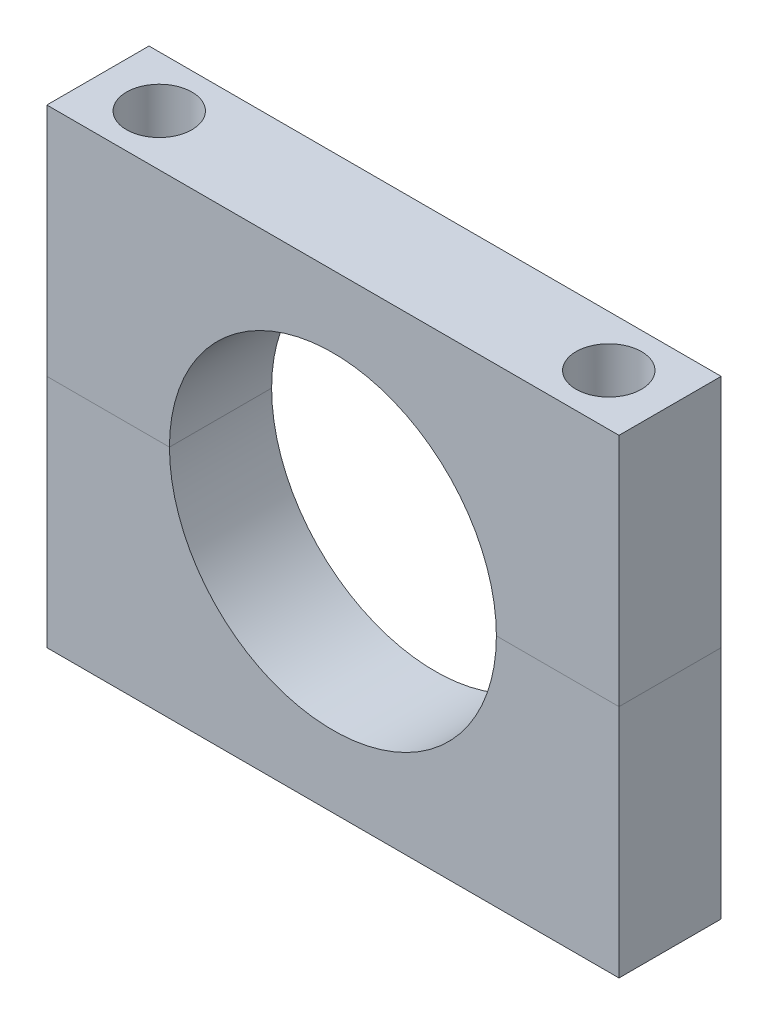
ISO-10303-21;
HEADER;
FILE_DESCRIPTION(('STEP AP214'),'2;1');
FILE_NAME('part.step','',(''),(''),'','','');
FILE_SCHEMA(('AUTOMOTIVE_DESIGN { 1 0 10303 214 1 1 1 1 }'));
ENDSEC;
DATA;
#1=APPLICATION_CONTEXT('core data for automotive mechanical design processes');
#2=APPLICATION_PROTOCOL_DEFINITION('international standard','automotive_design',2000,#1);
#3=PRODUCT_CONTEXT('',#1,'mechanical');
#4=PRODUCT('Part','Part','',(#3));
#5=PRODUCT_RELATED_PRODUCT_CATEGORY('part','',(#4));
#6=PRODUCT_DEFINITION_FORMATION('','',#4);
#7=PRODUCT_DEFINITION_CONTEXT('part definition',#1,'design');
#8=PRODUCT_DEFINITION('design','',#6,#7);
#9=PRODUCT_DEFINITION_SHAPE('','',#8);
#10=(LENGTH_UNIT() NAMED_UNIT(*) SI_UNIT(.MILLI.,.METRE.));
#11=(NAMED_UNIT(*) PLANE_ANGLE_UNIT() SI_UNIT($,.RADIAN.));
#12=(NAMED_UNIT(*) SI_UNIT($,.STERADIAN.) SOLID_ANGLE_UNIT());
#13=UNCERTAINTY_MEASURE_WITH_UNIT(LENGTH_MEASURE(1.E-05),#10,'distance_accuracy_value','');
#14=(GEOMETRIC_REPRESENTATION_CONTEXT(3) GLOBAL_UNCERTAINTY_ASSIGNED_CONTEXT((#13)) GLOBAL_UNIT_ASSIGNED_CONTEXT((#10,
#11,#12)) REPRESENTATION_CONTEXT('',''));
#15=CARTESIAN_POINT('',(0.,0.,0.));
#16=DIRECTION('',(0.,0.,1.));
#17=DIRECTION('',(1.,0.,0.));
#18=AXIS2_PLACEMENT_3D('',#15,#16,#17);
#19=CARTESIAN_POINT('',(0.,0.,0.));
#20=DIRECTION('',(0.,1.,0.));
#21=DIRECTION('',(0.,0.,1.));
#22=AXIS2_PLACEMENT_3D('',#19,#20,#21);
#23=PLANE('',#22);
#24=DIRECTION('',(1.,0.,0.));
#25=VECTOR('',#24,1.);
#26=CARTESIAN_POINT('',(0.,0.,5.));
#27=LINE('',#26,#25);
#28=CARTESIAN_POINT('',(7.99999999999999,0.,5.));
#29=VERTEX_POINT('',#28);
#30=CARTESIAN_POINT('',(14.,0.,5.));
#31=VERTEX_POINT('',#30);
#32=EDGE_CURVE('E151',#29,#31,#27,.T.);
#33=ORIENTED_EDGE('',*,*,#32,.T.);
#34=DIRECTION('',(0.,0.,-1.));
#35=VECTOR('',#34,1.);
#36=CARTESIAN_POINT('',(14.,0.,5.));
#37=LINE('',#36,#35);
#38=CARTESIAN_POINT('',(14.,0.,0.));
#39=VERTEX_POINT('',#38);
#40=EDGE_CURVE('E145',#31,#39,#37,.T.);
#41=ORIENTED_EDGE('',*,*,#40,.T.);
#42=DIRECTION('',(1.,0.,0.));
#43=VECTOR('',#42,1.);
#44=CARTESIAN_POINT('',(0.,0.,0.));
#45=LINE('',#44,#43);
#46=CARTESIAN_POINT('',(7.99999999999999,0.,0.));
#47=VERTEX_POINT('',#46);
#48=EDGE_CURVE('E138',#47,#39,#45,.T.);
#49=ORIENTED_EDGE('',*,*,#48,.F.);
#50=DIRECTION('',(0.,0.,-1.));
#51=VECTOR('',#50,1.);
#52=CARTESIAN_POINT('',(7.99999999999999,0.,5.));
#53=LINE('',#52,#51);
#54=EDGE_CURVE('E98',#29,#47,#53,.T.);
#55=ORIENTED_EDGE('',*,*,#54,.F.);
#56=EDGE_LOOP('',(#33,#41,#49,#55));
#57=FACE_BOUND('',#56,.T.);
#58=CARTESIAN_POINT('',(11.,0.,2.5));
#59=DIRECTION('',(0.,1.,0.));
#60=DIRECTION('',(0.,0.,1.));
#61=AXIS2_PLACEMENT_3D('',#58,#59,#60);
#62=CIRCLE('',#61,1.6);
#63=CARTESIAN_POINT('',(11.,0.,4.1));
#64=VERTEX_POINT('',#63);
#65=EDGE_CURVE('E146',#64,#64,#62,.F.);
#66=ORIENTED_EDGE('',*,*,#65,.T.);
#67=EDGE_LOOP('',(#66));
#68=FACE_BOUND('',#67,.T.);
#69=ADVANCED_FACE('F58',(#57,#68),#23,.T.);
#70=CARTESIAN_POINT('',(-14.,0.,0.));
#71=VERTEX_POINT('',#70);
#72=CARTESIAN_POINT('',(-8.00000000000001,0.,0.));
#73=VERTEX_POINT('',#72);
#74=EDGE_CURVE('E123',#71,#73,#45,.T.);
#75=ORIENTED_EDGE('',*,*,#74,.F.);
#76=DIRECTION('',(0.,0.,1.));
#77=VECTOR('',#76,1.);
#78=CARTESIAN_POINT('',(-14.,0.,5.));
#79=LINE('',#78,#77);
#80=CARTESIAN_POINT('',(-14.,0.,5.));
#81=VERTEX_POINT('',#80);
#82=EDGE_CURVE('E135',#71,#81,#79,.T.);
#83=ORIENTED_EDGE('',*,*,#82,.T.);
#84=CARTESIAN_POINT('',(-8.00000000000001,0.,5.));
#85=VERTEX_POINT('',#84);
#86=EDGE_CURVE('E139',#81,#85,#27,.T.);
#87=ORIENTED_EDGE('',*,*,#86,.T.);
#88=DIRECTION('',(0.,0.,-1.));
#89=VECTOR('',#88,1.);
#90=CARTESIAN_POINT('',(-8.00000000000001,0.,5.));
#91=LINE('',#90,#89);
#92=EDGE_CURVE('E136',#73,#85,#91,.F.);
#93=ORIENTED_EDGE('',*,*,#92,.F.);
#94=EDGE_LOOP('',(#75,#83,#87,#93));
#95=FACE_BOUND('',#94,.T.);
#96=CARTESIAN_POINT('',(-11.,0.,2.5));
#97=DIRECTION('',(0.,1.,0.));
#98=DIRECTION('',(0.,0.,1.));
#99=AXIS2_PLACEMENT_3D('',#96,#97,#98);
#100=CIRCLE('',#99,1.6);
#101=CARTESIAN_POINT('',(-11.,0.,4.1));
#102=VERTEX_POINT('',#101);
#103=EDGE_CURVE('E154',#102,#102,#100,.F.);
#104=ORIENTED_EDGE('',*,*,#103,.T.);
#105=EDGE_LOOP('',(#104));
#106=FACE_BOUND('',#105,.T.);
#107=ADVANCED_FACE('F132',(#95,#106),#23,.T.);
#108=CARTESIAN_POINT('',(0.,0.,5.));
#109=DIRECTION('',(0.,0.,-1.));
#110=DIRECTION('',(-1.,0.,0.));
#111=AXIS2_PLACEMENT_3D('',#108,#109,#110);
#112=PLANE('',#111);
#113=ORIENTED_EDGE('',*,*,#86,.F.);
#114=DIRECTION('',(0.,-1.,0.));
#115=VECTOR('',#114,1.);
#116=CARTESIAN_POINT('',(-14.,-11.5,5.));
#117=LINE('',#116,#115);
#118=CARTESIAN_POINT('',(-14.,-11.5,5.));
#119=VERTEX_POINT('',#118);
#120=EDGE_CURVE('E142',#81,#119,#117,.T.);
#121=ORIENTED_EDGE('',*,*,#120,.T.);
#122=DIRECTION('',(1.,0.,0.));
#123=VECTOR('',#122,1.);
#124=CARTESIAN_POINT('',(-14.,-11.5,5.));
#125=LINE('',#124,#123);
#126=CARTESIAN_POINT('',(14.,-11.5,5.));
#127=VERTEX_POINT('',#126);
#128=EDGE_CURVE('E90',#119,#127,#125,.T.);
#129=ORIENTED_EDGE('',*,*,#128,.T.);
#130=DIRECTION('',(0.,1.,0.));
#131=VECTOR('',#130,1.);
#132=CARTESIAN_POINT('',(14.,-11.5,5.));
#133=LINE('',#132,#131);
#134=EDGE_CURVE('E163',#127,#31,#133,.T.);
#135=ORIENTED_EDGE('',*,*,#134,.T.);
#136=ORIENTED_EDGE('',*,*,#32,.F.);
#137=CARTESIAN_POINT('',(0.,0.,5.));
#138=DIRECTION('',(0.,0.,1.));
#139=DIRECTION('',(1.,0.,0.));
#140=AXIS2_PLACEMENT_3D('',#137,#138,#139);
#141=CIRCLE('',#140,8.);
#142=EDGE_CURVE('E167',#85,#29,#141,.T.);
#143=ORIENTED_EDGE('',*,*,#142,.F.);
#144=EDGE_LOOP('',(#113,#121,#129,#135,#136,#143));
#145=FACE_BOUND('',#144,.T.);
#146=ADVANCED_FACE('F188',(#145),#112,.F.);
#147=CARTESIAN_POINT('',(0.,0.,0.));
#148=DIRECTION('',(0.,0.,-1.));
#149=DIRECTION('',(-1.,0.,0.));
#150=AXIS2_PLACEMENT_3D('',#147,#148,#149);
#151=PLANE('',#150);
#152=DIRECTION('',(0.,-1.,0.));
#153=VECTOR('',#152,1.);
#154=CARTESIAN_POINT('',(-14.,-11.5,0.));
#155=LINE('',#154,#153);
#156=CARTESIAN_POINT('',(-14.,-11.5,0.));
#157=VERTEX_POINT('',#156);
#158=EDGE_CURVE('E78',#71,#157,#155,.T.);
#159=ORIENTED_EDGE('',*,*,#158,.F.);
#160=ORIENTED_EDGE('',*,*,#74,.T.);
#161=CARTESIAN_POINT('',(0.,0.,0.));
#162=DIRECTION('',(0.,0.,1.));
#163=DIRECTION('',(1.,0.,0.));
#164=AXIS2_PLACEMENT_3D('',#161,#162,#163);
#165=CIRCLE('',#164,8.);
#166=EDGE_CURVE('E62',#73,#47,#165,.T.);
#167=ORIENTED_EDGE('',*,*,#166,.T.);
#168=ORIENTED_EDGE('',*,*,#48,.T.);
#169=DIRECTION('',(0.,1.,0.));
#170=VECTOR('',#169,1.);
#171=CARTESIAN_POINT('',(14.,-11.5,0.));
#172=LINE('',#171,#170);
#173=CARTESIAN_POINT('',(14.,-11.5,0.));
#174=VERTEX_POINT('',#173);
#175=EDGE_CURVE('E128',#174,#39,#172,.T.);
#176=ORIENTED_EDGE('',*,*,#175,.F.);
#177=DIRECTION('',(1.,0.,0.));
#178=VECTOR('',#177,1.);
#179=CARTESIAN_POINT('',(-14.,-11.5,0.));
#180=LINE('',#179,#178);
#181=EDGE_CURVE('E126',#157,#174,#180,.T.);
#182=ORIENTED_EDGE('',*,*,#181,.F.);
#183=EDGE_LOOP('',(#159,#160,#167,#168,#176,#182));
#184=FACE_BOUND('',#183,.T.);
#185=ADVANCED_FACE('F121',(#184),#151,.T.);
#186=CARTESIAN_POINT('',(14.,-11.5,5.));
#187=DIRECTION('',(-1.,0.,0.));
#188=DIRECTION('',(0.,0.,1.));
#189=AXIS2_PLACEMENT_3D('',#186,#187,#188);
#190=PLANE('',#189);
#191=ORIENTED_EDGE('',*,*,#40,.F.);
#192=ORIENTED_EDGE('',*,*,#134,.F.);
#193=DIRECTION('',(0.,0.,-1.));
#194=VECTOR('',#193,1.);
#195=CARTESIAN_POINT('',(14.,-11.5,5.));
#196=LINE('',#195,#194);
#197=EDGE_CURVE('E192',#127,#174,#196,.T.);
#198=ORIENTED_EDGE('',*,*,#197,.T.);
#199=ORIENTED_EDGE('',*,*,#175,.T.);
#200=EDGE_LOOP('',(#191,#192,#198,#199));
#201=FACE_BOUND('',#200,.T.);
#202=ADVANCED_FACE('F60',(#201),#190,.F.);
#203=CARTESIAN_POINT('',(-14.,-11.5,5.));
#204=DIRECTION('',(1.,0.,0.));
#205=DIRECTION('',(0.,0.,-1.));
#206=AXIS2_PLACEMENT_3D('',#203,#204,#205);
#207=PLANE('',#206);
#208=ORIENTED_EDGE('',*,*,#82,.F.);
#209=ORIENTED_EDGE('',*,*,#158,.T.);
#210=DIRECTION('',(0.,0.,-1.));
#211=VECTOR('',#210,1.);
#212=CARTESIAN_POINT('',(-14.,-11.5,5.));
#213=LINE('',#212,#211);
#214=EDGE_CURVE('E183',#119,#157,#213,.T.);
#215=ORIENTED_EDGE('',*,*,#214,.F.);
#216=ORIENTED_EDGE('',*,*,#120,.F.);
#217=EDGE_LOOP('',(#208,#209,#215,#216));
#218=FACE_BOUND('',#217,.T.);
#219=ADVANCED_FACE('F141',(#218),#207,.F.);
#220=CARTESIAN_POINT('',(0.,0.,5.));
#221=DIRECTION('',(0.,0.,-1.));
#222=DIRECTION('',(-1.,0.,0.));
#223=AXIS2_PLACEMENT_3D('',#220,#221,#222);
#224=CYLINDRICAL_SURFACE('',#223,8.);
#225=ORIENTED_EDGE('',*,*,#142,.T.);
#226=ORIENTED_EDGE('',*,*,#54,.T.);
#227=ORIENTED_EDGE('',*,*,#166,.F.);
#228=ORIENTED_EDGE('',*,*,#92,.T.);
#229=EDGE_LOOP('',(#225,#226,#227,#228));
#230=FACE_BOUND('',#229,.T.);
#231=ADVANCED_FACE('F224',(#230),#224,.F.);
#232=CARTESIAN_POINT('',(11.,-11.5,2.5));
#233=DIRECTION('',(0.,1.,0.));
#234=DIRECTION('',(0.,0.,1.));
#235=AXIS2_PLACEMENT_3D('',#232,#233,#234);
#236=CYLINDRICAL_SURFACE('',#235,1.6);
#237=CARTESIAN_POINT('',(11.,-11.5,2.5));
#238=DIRECTION('',(0.,1.,0.));
#239=DIRECTION('',(0.,0.,-1.));
#240=AXIS2_PLACEMENT_3D('',#237,#238,#239);
#241=CIRCLE('',#240,1.6);
#242=CARTESIAN_POINT('',(11.,-11.5,0.899999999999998));
#243=VERTEX_POINT('',#242);
#244=EDGE_CURVE('E12',#243,#243,#241,.T.);
#245=ORIENTED_EDGE('',*,*,#244,.F.);
#246=EDGE_LOOP('',(#245));
#247=FACE_BOUND('',#246,.T.);
#248=ORIENTED_EDGE('',*,*,#65,.F.);
#249=EDGE_LOOP('',(#248));
#250=FACE_BOUND('',#249,.T.);
#251=ADVANCED_FACE('F210',(#247,#250),#236,.F.);
#252=CARTESIAN_POINT('',(-11.,-11.5,2.5));
#253=DIRECTION('',(0.,1.,0.));
#254=DIRECTION('',(0.,0.,1.));
#255=AXIS2_PLACEMENT_3D('',#252,#253,#254);
#256=CYLINDRICAL_SURFACE('',#255,1.6);
#257=CARTESIAN_POINT('',(-11.,-11.5,2.5));
#258=DIRECTION('',(0.,1.,0.));
#259=DIRECTION('',(0.,0.,1.));
#260=AXIS2_PLACEMENT_3D('',#257,#258,#259);
#261=CIRCLE('',#260,1.6);
#262=CARTESIAN_POINT('',(-11.,-11.5,4.1));
#263=VERTEX_POINT('',#262);
#264=EDGE_CURVE('E69',#263,#263,#261,.T.);
#265=ORIENTED_EDGE('',*,*,#264,.F.);
#266=EDGE_LOOP('',(#265));
#267=FACE_BOUND('',#266,.T.);
#268=ORIENTED_EDGE('',*,*,#103,.F.);
#269=EDGE_LOOP('',(#268));
#270=FACE_BOUND('',#269,.T.);
#271=ADVANCED_FACE('F205',(#267,#270),#256,.F.);
#272=CARTESIAN_POINT('',(-14.,-11.5,5.));
#273=DIRECTION('',(0.,1.,0.));
#274=DIRECTION('',(0.,0.,1.));
#275=AXIS2_PLACEMENT_3D('',#272,#273,#274);
#276=PLANE('',#275);
#277=ORIENTED_EDGE('',*,*,#264,.T.);
#278=EDGE_LOOP('',(#277));
#279=FACE_BOUND('',#278,.T.);
#280=ORIENTED_EDGE('',*,*,#244,.T.);
#281=EDGE_LOOP('',(#280));
#282=FACE_BOUND('',#281,.T.);
#283=ORIENTED_EDGE('',*,*,#181,.T.);
#284=ORIENTED_EDGE('',*,*,#197,.F.);
#285=ORIENTED_EDGE('',*,*,#128,.F.);
#286=ORIENTED_EDGE('',*,*,#214,.T.);
#287=EDGE_LOOP('',(#283,#284,#285,#286));
#288=FACE_BOUND('',#287,.T.);
#289=ADVANCED_FACE('F203',(#279,#282,#288),#276,.F.);
#290=CLOSED_SHELL('',(#69,#107,#146,#185,#202,#219,#231,#251,#271,#289));
#291=MANIFOLD_SOLID_BREP('B2',#290);
#292=CARTESIAN_POINT('',(0.,0.,0.));
#293=DIRECTION('',(0.,1.,0.));
#294=DIRECTION('',(0.,0.,1.));
#295=AXIS2_PLACEMENT_3D('',#292,#293,#294);
#296=PLANE('',#295);
#297=CARTESIAN_POINT('',(11.,0.,2.5));
#298=DIRECTION('',(0.,1.,0.));
#299=DIRECTION('',(0.,0.,1.));
#300=AXIS2_PLACEMENT_3D('',#297,#298,#299);
#301=CIRCLE('',#300,1.6);
#302=CARTESIAN_POINT('',(11.,0.,4.1));
#303=VERTEX_POINT('',#302);
#304=EDGE_CURVE('E391',#303,#303,#301,.F.);
#305=ORIENTED_EDGE('',*,*,#304,.F.);
#306=EDGE_LOOP('',(#305));
#307=FACE_BOUND('',#306,.T.);
#308=DIRECTION('',(1.,0.,0.));
#309=VECTOR('',#308,1.);
#310=CARTESIAN_POINT('',(0.,0.,5.));
#311=LINE('',#310,#309);
#312=CARTESIAN_POINT('',(7.99999999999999,0.,5.));
#313=VERTEX_POINT('',#312);
#314=CARTESIAN_POINT('',(14.,0.,5.));
#315=VERTEX_POINT('',#314);
#316=EDGE_CURVE('E370',#313,#315,#311,.T.);
#317=ORIENTED_EDGE('',*,*,#316,.F.);
#318=DIRECTION('',(0.,0.,-1.));
#319=VECTOR('',#318,1.);
#320=CARTESIAN_POINT('',(7.99999999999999,0.,5.));
#321=LINE('',#320,#319);
#322=CARTESIAN_POINT('',(7.99999999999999,0.,0.));
#323=VERTEX_POINT('',#322);
#324=EDGE_CURVE('E318',#313,#323,#321,.T.);
#325=ORIENTED_EDGE('',*,*,#324,.T.);
#326=DIRECTION('',(1.,0.,0.));
#327=VECTOR('',#326,1.);
#328=CARTESIAN_POINT('',(0.,0.,0.));
#329=LINE('',#328,#327);
#330=CARTESIAN_POINT('',(14.,0.,0.));
#331=VERTEX_POINT('',#330);
#332=EDGE_CURVE('E399',#323,#331,#329,.T.);
#333=ORIENTED_EDGE('',*,*,#332,.T.);
#334=DIRECTION('',(0.,0.,-1.));
#335=VECTOR('',#334,1.);
#336=CARTESIAN_POINT('',(14.,0.,5.));
#337=LINE('',#336,#335);
#338=EDGE_CURVE('E313',#315,#331,#337,.T.);
#339=ORIENTED_EDGE('',*,*,#338,.F.);
#340=EDGE_LOOP('',(#317,#325,#333,#339));
#341=FACE_BOUND('',#340,.T.);
#342=ADVANCED_FACE('F310',(#307,#341),#296,.F.);
#343=CARTESIAN_POINT('',(-11.,0.,2.5));
#344=DIRECTION('',(0.,1.,0.));
#345=DIRECTION('',(0.,0.,1.));
#346=AXIS2_PLACEMENT_3D('',#343,#344,#345);
#347=CIRCLE('',#346,1.6);
#348=CARTESIAN_POINT('',(-11.,0.,4.1));
#349=VERTEX_POINT('',#348);
#350=EDGE_CURVE('E388',#349,#349,#347,.F.);
#351=ORIENTED_EDGE('',*,*,#350,.F.);
#352=EDGE_LOOP('',(#351));
#353=FACE_BOUND('',#352,.T.);
#354=CARTESIAN_POINT('',(-14.,0.,0.));
#355=VERTEX_POINT('',#354);
#356=CARTESIAN_POINT('',(-8.00000000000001,0.,0.));
#357=VERTEX_POINT('',#356);
#358=EDGE_CURVE('E402',#355,#357,#329,.T.);
#359=ORIENTED_EDGE('',*,*,#358,.T.);
#360=DIRECTION('',(0.,0.,-1.));
#361=VECTOR('',#360,1.);
#362=CARTESIAN_POINT('',(-8.00000000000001,0.,5.));
#363=LINE('',#362,#361);
#364=CARTESIAN_POINT('',(-8.00000000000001,0.,5.));
#365=VERTEX_POINT('',#364);
#366=EDGE_CURVE('E56',#357,#365,#363,.F.);
#367=ORIENTED_EDGE('',*,*,#366,.T.);
#368=CARTESIAN_POINT('',(-14.,0.,5.));
#369=VERTEX_POINT('',#368);
#370=EDGE_CURVE('E333',#369,#365,#311,.T.);
#371=ORIENTED_EDGE('',*,*,#370,.F.);
#372=DIRECTION('',(0.,0.,1.));
#373=VECTOR('',#372,1.);
#374=CARTESIAN_POINT('',(-14.,0.,5.));
#375=LINE('',#374,#373);
#376=EDGE_CURVE('E397',#355,#369,#375,.T.);
#377=ORIENTED_EDGE('',*,*,#376,.F.);
#378=EDGE_LOOP('',(#359,#367,#371,#377));
#379=FACE_BOUND('',#378,.T.);
#380=ADVANCED_FACE('F429',(#353,#379),#296,.F.);
#381=CARTESIAN_POINT('',(-14.,11.5,5.));
#382=DIRECTION('',(0.,-1.,0.));
#383=DIRECTION('',(0.,0.,-1.));
#384=AXIS2_PLACEMENT_3D('',#381,#382,#383);
#385=PLANE('',#384);
#386=CARTESIAN_POINT('',(-11.,11.5,2.5));
#387=DIRECTION('',(0.,1.,0.));
#388=DIRECTION('',(0.,0.,1.));
#389=AXIS2_PLACEMENT_3D('',#386,#387,#388);
#390=CIRCLE('',#389,1.6);
#391=CARTESIAN_POINT('',(-11.,11.5,4.1));
#392=VERTEX_POINT('',#391);
#393=EDGE_CURVE('E412',#392,#392,#390,.T.);
#394=ORIENTED_EDGE('',*,*,#393,.F.);
#395=EDGE_LOOP('',(#394));
#396=FACE_BOUND('',#395,.T.);
#397=CARTESIAN_POINT('',(11.,11.5,2.5));
#398=DIRECTION('',(0.,1.,0.));
#399=DIRECTION('',(0.,0.,-1.));
#400=AXIS2_PLACEMENT_3D('',#397,#398,#399);
#401=CIRCLE('',#400,1.6);
#402=CARTESIAN_POINT('',(11.,11.5,0.899999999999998));
#403=VERTEX_POINT('',#402);
#404=EDGE_CURVE('E416',#403,#403,#401,.T.);
#405=ORIENTED_EDGE('',*,*,#404,.F.);
#406=EDGE_LOOP('',(#405));
#407=FACE_BOUND('',#406,.T.);
#408=DIRECTION('',(-1.,0.,0.));
#409=VECTOR('',#408,1.);
#410=CARTESIAN_POINT('',(-14.,11.5,0.));
#411=LINE('',#410,#409);
#412=CARTESIAN_POINT('',(14.,11.5,0.));
#413=VERTEX_POINT('',#412);
#414=CARTESIAN_POINT('',(-14.,11.5,0.));
#415=VERTEX_POINT('',#414);
#416=EDGE_CURVE('E422',#413,#415,#411,.T.);
#417=ORIENTED_EDGE('',*,*,#416,.T.);
#418=DIRECTION('',(0.,0.,-1.));
#419=VECTOR('',#418,1.);
#420=CARTESIAN_POINT('',(-14.,11.5,5.));
#421=LINE('',#420,#419);
#422=CARTESIAN_POINT('',(-14.,11.5,5.));
#423=VERTEX_POINT('',#422);
#424=EDGE_CURVE('E380',#423,#415,#421,.T.);
#425=ORIENTED_EDGE('',*,*,#424,.F.);
#426=DIRECTION('',(-1.,0.,0.));
#427=VECTOR('',#426,1.);
#428=CARTESIAN_POINT('',(-14.,11.5,5.));
#429=LINE('',#428,#427);
#430=CARTESIAN_POINT('',(14.,11.5,5.));
#431=VERTEX_POINT('',#430);
#432=EDGE_CURVE('E368',#431,#423,#429,.T.);
#433=ORIENTED_EDGE('',*,*,#432,.F.);
#434=DIRECTION('',(0.,0.,-1.));
#435=VECTOR('',#434,1.);
#436=CARTESIAN_POINT('',(14.,11.5,5.));
#437=LINE('',#436,#435);
#438=EDGE_CURVE('E378',#431,#413,#437,.T.);
#439=ORIENTED_EDGE('',*,*,#438,.T.);
#440=EDGE_LOOP('',(#417,#425,#433,#439));
#441=FACE_BOUND('',#440,.T.);
#442=ADVANCED_FACE('F377',(#396,#407,#441),#385,.F.);
#443=CARTESIAN_POINT('',(-11.,-11.5,2.5));
#444=DIRECTION('',(0.,1.,0.));
#445=DIRECTION('',(0.,0.,1.));
#446=AXIS2_PLACEMENT_3D('',#443,#444,#445);
#447=CYLINDRICAL_SURFACE('',#446,1.6);
#448=ORIENTED_EDGE('',*,*,#350,.T.);
#449=EDGE_LOOP('',(#448));
#450=FACE_BOUND('',#449,.T.);
#451=ORIENTED_EDGE('',*,*,#393,.T.);
#452=EDGE_LOOP('',(#451));
#453=FACE_BOUND('',#452,.T.);
#454=ADVANCED_FACE('F436',(#450,#453),#447,.F.);
#455=CARTESIAN_POINT('',(11.,-11.5,2.5));
#456=DIRECTION('',(0.,1.,0.));
#457=DIRECTION('',(0.,0.,1.));
#458=AXIS2_PLACEMENT_3D('',#455,#456,#457);
#459=CYLINDRICAL_SURFACE('',#458,1.6);
#460=ORIENTED_EDGE('',*,*,#304,.T.);
#461=EDGE_LOOP('',(#460));
#462=FACE_BOUND('',#461,.T.);
#463=ORIENTED_EDGE('',*,*,#404,.T.);
#464=EDGE_LOOP('',(#463));
#465=FACE_BOUND('',#464,.T.);
#466=ADVANCED_FACE('F449',(#462,#465),#459,.F.);
#467=CARTESIAN_POINT('',(0.,0.,0.));
#468=DIRECTION('',(0.,0.,-1.));
#469=DIRECTION('',(-1.,0.,0.));
#470=AXIS2_PLACEMENT_3D('',#467,#468,#469);
#471=PLANE('',#470);
#472=ORIENTED_EDGE('',*,*,#358,.F.);
#473=DIRECTION('',(0.,-1.,0.));
#474=VECTOR('',#473,1.);
#475=CARTESIAN_POINT('',(-14.,-11.5,0.));
#476=LINE('',#475,#474);
#477=EDGE_CURVE('E373',#415,#355,#476,.T.);
#478=ORIENTED_EDGE('',*,*,#477,.F.);
#479=ORIENTED_EDGE('',*,*,#416,.F.);
#480=DIRECTION('',(0.,1.,0.));
#481=VECTOR('',#480,1.);
#482=CARTESIAN_POINT('',(14.,-11.5,0.));
#483=LINE('',#482,#481);
#484=EDGE_CURVE('E386',#331,#413,#483,.T.);
#485=ORIENTED_EDGE('',*,*,#484,.F.);
#486=ORIENTED_EDGE('',*,*,#332,.F.);
#487=CARTESIAN_POINT('',(0.,0.,0.));
#488=DIRECTION('',(0.,0.,1.));
#489=DIRECTION('',(1.,0.,0.));
#490=AXIS2_PLACEMENT_3D('',#487,#488,#489);
#491=CIRCLE('',#490,8.);
#492=EDGE_CURVE('E406',#323,#357,#491,.T.);
#493=ORIENTED_EDGE('',*,*,#492,.T.);
#494=EDGE_LOOP('',(#472,#478,#479,#485,#486,#493));
#495=FACE_BOUND('',#494,.T.);
#496=ADVANCED_FACE('F427',(#495),#471,.T.);
#497=CARTESIAN_POINT('',(0.,0.,5.));
#498=DIRECTION('',(0.,0.,-1.));
#499=DIRECTION('',(-1.,0.,0.));
#500=AXIS2_PLACEMENT_3D('',#497,#498,#499);
#501=PLANE('',#500);
#502=DIRECTION('',(0.,-1.,0.));
#503=VECTOR('',#502,1.);
#504=CARTESIAN_POINT('',(-14.,-11.5,5.));
#505=LINE('',#504,#503);
#506=EDGE_CURVE('E382',#423,#369,#505,.T.);
#507=ORIENTED_EDGE('',*,*,#506,.T.);
#508=ORIENTED_EDGE('',*,*,#370,.T.);
#509=CARTESIAN_POINT('',(0.,0.,5.));
#510=DIRECTION('',(0.,0.,1.));
#511=DIRECTION('',(1.,0.,0.));
#512=AXIS2_PLACEMENT_3D('',#509,#510,#511);
#513=CIRCLE('',#512,8.);
#514=EDGE_CURVE('E411',#313,#365,#513,.T.);
#515=ORIENTED_EDGE('',*,*,#514,.F.);
#516=ORIENTED_EDGE('',*,*,#316,.T.);
#517=DIRECTION('',(0.,1.,0.));
#518=VECTOR('',#517,1.);
#519=CARTESIAN_POINT('',(14.,-11.5,5.));
#520=LINE('',#519,#518);
#521=EDGE_CURVE('E365',#315,#431,#520,.T.);
#522=ORIENTED_EDGE('',*,*,#521,.T.);
#523=ORIENTED_EDGE('',*,*,#432,.T.);
#524=EDGE_LOOP('',(#507,#508,#515,#516,#522,#523));
#525=FACE_BOUND('',#524,.T.);
#526=ADVANCED_FACE('F367',(#525),#501,.F.);
#527=CARTESIAN_POINT('',(0.,0.,5.));
#528=DIRECTION('',(0.,0.,-1.));
#529=DIRECTION('',(-1.,0.,0.));
#530=AXIS2_PLACEMENT_3D('',#527,#528,#529);
#531=CYLINDRICAL_SURFACE('',#530,8.);
#532=ORIENTED_EDGE('',*,*,#324,.F.);
#533=ORIENTED_EDGE('',*,*,#514,.T.);
#534=ORIENTED_EDGE('',*,*,#366,.F.);
#535=ORIENTED_EDGE('',*,*,#492,.F.);
#536=EDGE_LOOP('',(#532,#533,#534,#535));
#537=FACE_BOUND('',#536,.T.);
#538=ADVANCED_FACE('F407',(#537),#531,.F.);
#539=CARTESIAN_POINT('',(-14.,-11.5,5.));
#540=DIRECTION('',(1.,0.,0.));
#541=DIRECTION('',(0.,0.,-1.));
#542=AXIS2_PLACEMENT_3D('',#539,#540,#541);
#543=PLANE('',#542);
#544=ORIENTED_EDGE('',*,*,#477,.T.);
#545=ORIENTED_EDGE('',*,*,#376,.T.);
#546=ORIENTED_EDGE('',*,*,#506,.F.);
#547=ORIENTED_EDGE('',*,*,#424,.T.);
#548=EDGE_LOOP('',(#544,#545,#546,#547));
#549=FACE_BOUND('',#548,.T.);
#550=ADVANCED_FACE('F426',(#549),#543,.F.);
#551=CARTESIAN_POINT('',(14.,-11.5,5.));
#552=DIRECTION('',(-1.,0.,0.));
#553=DIRECTION('',(0.,0.,1.));
#554=AXIS2_PLACEMENT_3D('',#551,#552,#553);
#555=PLANE('',#554);
#556=ORIENTED_EDGE('',*,*,#521,.F.);
#557=ORIENTED_EDGE('',*,*,#338,.T.);
#558=ORIENTED_EDGE('',*,*,#484,.T.);
#559=ORIENTED_EDGE('',*,*,#438,.F.);
#560=EDGE_LOOP('',(#556,#557,#558,#559));
#561=FACE_BOUND('',#560,.T.);
#562=ADVANCED_FACE('F384',(#561),#555,.F.);
#563=CLOSED_SHELL('',(#342,#380,#442,#454,#466,#496,#526,#538,#550,#562));
#564=MANIFOLD_SOLID_BREP('B6',#563);
#565=ADVANCED_BREP_SHAPE_REPRESENTATION('',(#18,#291,#564),#14);
#566=SHAPE_DEFINITION_REPRESENTATION(#9,#565);
ENDSEC;
END-ISO-10303-21;
